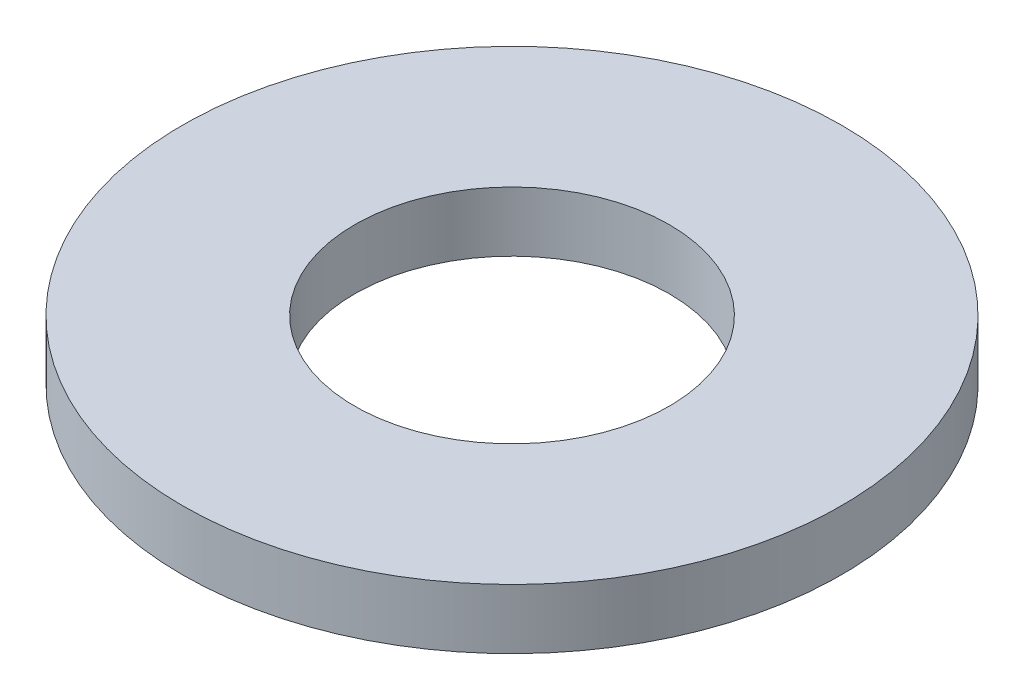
from build123d import *

# Parameters (mm, degrees)
ESQUISSE1_W = 5.75
ESQUISSE1_H = 2


with BuildPart() as part:
    # Esquisse1 → Base-R_volution (revolve)
    with BuildSketch(Plane.XY, mode=Mode.PRIVATE) as base_r_volution_sk:
        with Locations((8.125, 1)):
            Rectangle(ESQUISSE1_W, ESQUISSE1_H)
    revolve(base_r_volution_sk.sketch.rotate(Axis((0, 0, 0), (0, 1, 0)), 90), axis=Axis((0, 0, 0), (0, 1, 0)))


solid = part.part
